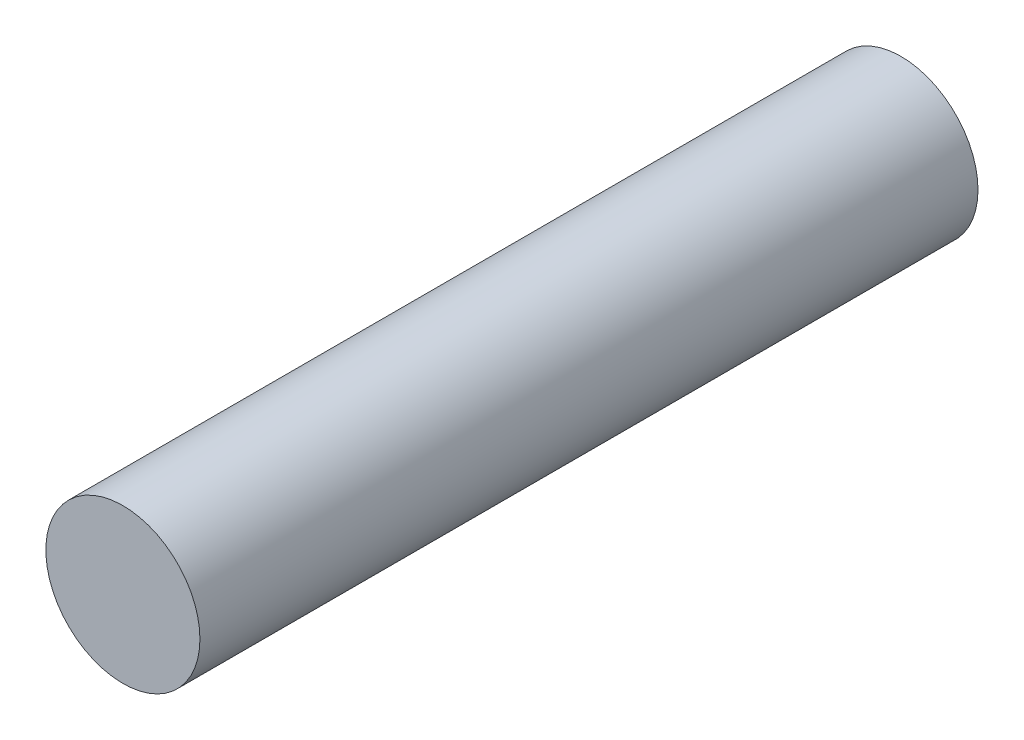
from build123d import *

# Parameters (mm, degrees)
SKIZZE1_R               = 10.891822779
LINEAR_AUSTRAGEN1_DEPTH = 110


with BuildPart() as part:
    # Skizze1 → Linear austragen1 (new body)
    with BuildSketch(Plane.XY):
        Circle(SKIZZE1_R)
    extrude(amount=LINEAR_AUSTRAGEN1_DEPTH)


solid = part.part
